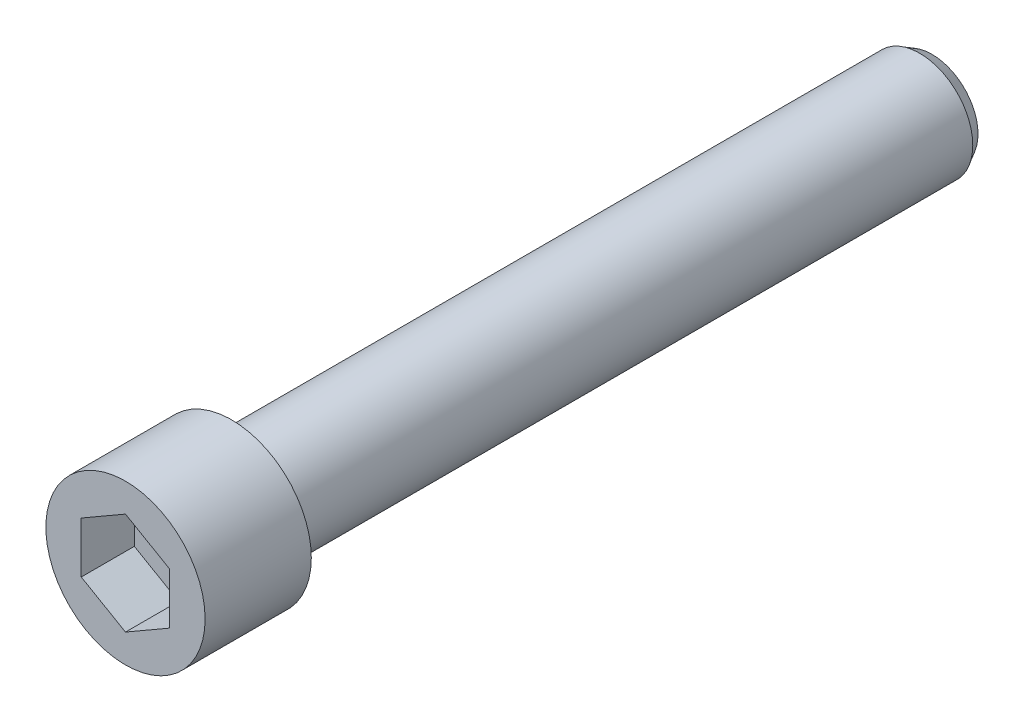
ISO-10303-21;
HEADER;
FILE_DESCRIPTION(('STEP AP214'),'2;1');
FILE_NAME('part.step','',(''),(''),'','','');
FILE_SCHEMA(('AUTOMOTIVE_DESIGN { 1 0 10303 214 1 1 1 1 }'));
ENDSEC;
DATA;
#1=APPLICATION_CONTEXT('core data for automotive mechanical design processes');
#2=APPLICATION_PROTOCOL_DEFINITION('international standard','automotive_design',2000,#1);
#3=PRODUCT_CONTEXT('',#1,'mechanical');
#4=PRODUCT('Part','Part','',(#3));
#5=PRODUCT_RELATED_PRODUCT_CATEGORY('part','',(#4));
#6=PRODUCT_DEFINITION_FORMATION('','',#4);
#7=PRODUCT_DEFINITION_CONTEXT('part definition',#1,'design');
#8=PRODUCT_DEFINITION('design','',#6,#7);
#9=PRODUCT_DEFINITION_SHAPE('','',#8);
#10=(LENGTH_UNIT() NAMED_UNIT(*) SI_UNIT(.MILLI.,.METRE.));
#11=(NAMED_UNIT(*) PLANE_ANGLE_UNIT() SI_UNIT($,.RADIAN.));
#12=(NAMED_UNIT(*) SI_UNIT($,.STERADIAN.) SOLID_ANGLE_UNIT());
#13=UNCERTAINTY_MEASURE_WITH_UNIT(LENGTH_MEASURE(1.E-05),#10,'distance_accuracy_value','');
#14=(GEOMETRIC_REPRESENTATION_CONTEXT(3) GLOBAL_UNCERTAINTY_ASSIGNED_CONTEXT((#13)) GLOBAL_UNIT_ASSIGNED_CONTEXT((#10,
#11,#12)) REPRESENTATION_CONTEXT('',''));
#15=CARTESIAN_POINT('',(0.,0.,0.));
#16=DIRECTION('',(0.,0.,1.));
#17=DIRECTION('',(1.,0.,0.));
#18=AXIS2_PLACEMENT_3D('',#15,#16,#17);
#19=CARTESIAN_POINT('',(0.,0.,2.35));
#20=DIRECTION('',(0.,0.,-1.));
#21=DIRECTION('',(1.,0.,0.));
#22=AXIS2_PLACEMENT_3D('',#19,#20,#21);
#23=SPHERICAL_SURFACE('',#22,4.35);
#24=CARTESIAN_POINT('',(0.,0.,0.85));
#25=DIRECTION('',(0.,0.,-1.));
#26=DIRECTION('',(1.,0.,0.));
#27=AXIS2_PLACEMENT_3D('',#24,#25,#26);
#28=CIRCLE('',#27,4.08319727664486);
#29=CARTESIAN_POINT('',(4.08319727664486,0.,0.85));
#30=VERTEX_POINT('',#29);
#31=EDGE_CURVE('E9',#30,#30,#28,.T.);
#32=CARTESIAN_POINT('',(0.,0.,0.));
#33=DIRECTION('',(0.,0.,-1.));
#34=DIRECTION('',(1.,0.,0.));
#35=AXIS2_PLACEMENT_3D('',#32,#33,#34);
#36=CIRCLE('',#35,3.66060104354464);
#37=CARTESIAN_POINT('',(3.66060104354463,0.,0.));
#38=VERTEX_POINT('',#37);
#39=EDGE_CURVE('E17',#38,#38,#36,.F.);
#40=CARTESIAN_POINT('',(4.08319727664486,0.,0.85));
#41=CARTESIAN_POINT('',(4.07978079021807,0.,0.840699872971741));
#42=CARTESIAN_POINT('',(4.07633252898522,0.,0.831411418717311));
#43=CARTESIAN_POINT('',(4.06937262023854,0.,0.812858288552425));
#44=CARTESIAN_POINT('',(4.06586097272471,0.,0.803593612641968));
#45=CARTESIAN_POINT('',(4.0587744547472,0.,0.785088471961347));
#46=CARTESIAN_POINT('',(4.05519958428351,0.,0.775848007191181));
#47=CARTESIAN_POINT('',(4.04798678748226,0.,0.757391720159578));
#48=CARTESIAN_POINT('',(4.04434886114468,0.,0.74817589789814));
#49=CARTESIAN_POINT('',(4.03701012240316,0.,0.729769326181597));
#50=CARTESIAN_POINT('',(4.03330930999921,0.,0.720578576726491));
#51=CARTESIAN_POINT('',(4.0258449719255,0.,0.702222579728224));
#52=CARTESIAN_POINT('',(4.02208144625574,0.,0.693057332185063));
#53=CARTESIAN_POINT('',(4.01449185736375,0.,0.674752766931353));
#54=CARTESIAN_POINT('',(4.01066579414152,0.,0.665613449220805));
#55=CARTESIAN_POINT('',(4.00295130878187,0.,0.647361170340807));
#56=CARTESIAN_POINT('',(3.99906288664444,0.,0.638248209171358));
#57=CARTESIAN_POINT('',(3.99122386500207,0.,0.620049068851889));
#58=CARTESIAN_POINT('',(3.98727326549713,0.,0.610962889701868));
#59=CARTESIAN_POINT('',(3.9793100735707,0.,0.592817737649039));
#60=CARTESIAN_POINT('',(3.97529748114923,0.,0.58375876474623));
#61=CARTESIAN_POINT('',(3.96721049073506,0.,0.565668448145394));
#62=CARTESIAN_POINT('',(3.96313609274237,0.,0.556637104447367));
#63=CARTESIAN_POINT('',(3.95492568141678,0.,0.538602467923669));
#64=CARTESIAN_POINT('',(3.95078966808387,0.,0.529599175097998));
#65=CARTESIAN_POINT('',(3.94245621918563,0.,0.51162106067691));
#66=CARTESIAN_POINT('',(3.9382587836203,0.,0.502646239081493));
#67=CARTESIAN_POINT('',(3.92980268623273,0.,0.484725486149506));
#68=CARTESIAN_POINT('',(3.9255440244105,0.,0.475779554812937));
#69=CARTESIAN_POINT('',(3.9169656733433,0.,0.457917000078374));
#70=CARTESIAN_POINT('',(3.91264598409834,0.,0.44900037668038));
#71=CARTESIAN_POINT('',(3.90394577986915,0.,0.431196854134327));
#72=CARTESIAN_POINT('',(3.89956526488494,0.,0.422309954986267));
#73=CARTESIAN_POINT('',(3.89074361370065,0.,0.404566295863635));
#74=CARTESIAN_POINT('',(3.88630247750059,0.,0.395709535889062));
#75=CARTESIAN_POINT('',(3.87735979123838,0.,0.378026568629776));
#76=CARTESIAN_POINT('',(3.87285824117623,0.,0.369200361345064));
#77=CARTESIAN_POINT('',(3.8637949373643,0.,0.351578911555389));
#78=CARTESIAN_POINT('',(3.85923318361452,0.,0.342783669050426));
#79=CARTESIAN_POINT('',(3.85004968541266,0.,0.325224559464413));
#80=CARTESIAN_POINT('',(3.84542794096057,0.,0.316460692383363));
#81=CARTESIAN_POINT('',(3.83612467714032,0.,0.298964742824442));
#82=CARTESIAN_POINT('',(3.83144315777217,0.,0.290232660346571));
#83=CARTESIAN_POINT('',(3.82202056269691,0.,0.272800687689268));
#84=CARTESIAN_POINT('',(3.8172794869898,0.,0.264100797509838));
#85=CARTESIAN_POINT('',(3.80773800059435,0.,0.246733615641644));
#86=CARTESIAN_POINT('',(3.80293758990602,0.,0.238066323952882));
#87=CARTESIAN_POINT('',(3.79327765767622,0.,0.220764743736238));
#88=CARTESIAN_POINT('',(3.78841813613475,0.,0.212130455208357));
#89=CARTESIAN_POINT('',(3.77864020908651,0.,0.194895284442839));
#90=CARTESIAN_POINT('',(3.77372180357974,0.,0.186294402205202));
#91=CARTESIAN_POINT('',(3.76382633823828,0.,0.169126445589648));
#92=CARTESIAN_POINT('',(3.75884927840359,0.,0.160559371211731));
#93=CARTESIAN_POINT('',(3.7488367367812,0.,0.143459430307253));
#94=CARTESIAN_POINT('',(3.7438012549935,0.,0.134926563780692));
#95=CARTESIAN_POINT('',(3.73367210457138,0.,0.117895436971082));
#96=CARTESIAN_POINT('',(3.72857843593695,0.,0.109397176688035));
#97=CARTESIAN_POINT('',(3.7183331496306,0.,0.0924356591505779));
#98=CARTESIAN_POINT('',(3.71318153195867,0.,0.0839724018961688));
#99=CARTESIAN_POINT('',(3.70282058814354,0.,0.0670812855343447));
#100=CARTESIAN_POINT('',(3.69761126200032,0.,0.0586534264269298));
#101=CARTESIAN_POINT('',(3.6871351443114,0.,0.0418334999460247));
#102=CARTESIAN_POINT('',(3.68186835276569,0.,0.0334414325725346));
#103=CARTESIAN_POINT('',(3.67127755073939,0.,0.0166934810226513));
#104=CARTESIAN_POINT('',(3.66595354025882,0.,0.00833759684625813));
#105=CARTESIAN_POINT('',(3.66060104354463,0.,0.));
#106=B_SPLINE_CURVE_WITH_KNOTS('',3,(#40,#41,#42,#43,#44,#45,#46,#47,#48,#49,#50,#51,#52,#53,
#54,#55,#56,#57,#58,#59,#60,#61,#62,#63,#64,#65,#66,#67,#68,#69,#70,#71,#72,#73,#74,#75,#76,#77,
#78,#79,#80,#81,#82,#83,#84,#85,#86,#87,#88,#89,#90,#91,#92,#93,#94,#95,#96,#97,#98,#99,#100,
#101,#102,#103,#104,#105),.UNSPECIFIED.,.F.,.F.,(4,2,2,2,2,2,2,2,2,2,2,2,2,2,2,2,2,2,2,2,2,2,2,
2,2,2,2,2,2,2,2,2,4),(0.,0.0297233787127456,0.0594467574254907,0.0891701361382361,
0.118893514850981,0.148616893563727,0.178340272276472,0.208063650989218,0.237787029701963,
0.267510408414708,0.297233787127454,0.326957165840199,0.356680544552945,0.38640392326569,
0.416127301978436,0.445850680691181,0.475574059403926,0.505297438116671,0.535020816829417,
0.564744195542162,0.594467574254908,0.624190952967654,0.653914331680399,0.683637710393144,
0.71336108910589,0.743084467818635,0.77280784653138,0.802531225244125,0.832254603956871,
0.861977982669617,0.891701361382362,0.921424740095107,0.951148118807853),.UNSPECIFIED.);
#107=EDGE_CURVE('BSEAM14',#30,#38,#106,.T.);
#108=ORIENTED_EDGE('',*,*,#31,.T.);
#109=ORIENTED_EDGE('',*,*,#39,.T.);
#110=ORIENTED_EDGE('',*,*,#107,.T.);
#111=ORIENTED_EDGE('',*,*,#107,.F.);
#112=EDGE_LOOP('',(#108,#110,#109,#111));
#113=FACE_BOUND('',#112,.T.);
#114=ADVANCED_FACE('F14',(#113),#23,.T.);
#115=CARTESIAN_POINT('',(5.19170962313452,0.,0.85));
#116=DIRECTION('',(0.,0.,1.));
#117=DIRECTION('',(-1.,0.,0.));
#118=AXIS2_PLACEMENT_3D('',#115,#116,#117);
#119=PLANE('',#118);
#120=ORIENTED_EDGE('',*,*,#31,.F.);
#121=EDGE_LOOP('',(#120));
#122=FACE_BOUND('',#121,.T.);
#123=CARTESIAN_POINT('',(0.,0.,0.85));
#124=DIRECTION('',(0.,0.,-1.));
#125=DIRECTION('',(1.,0.,0.));
#126=AXIS2_PLACEMENT_3D('',#123,#124,#125);
#127=CIRCLE('',#126,5.19170962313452);
#128=CARTESIAN_POINT('',(5.19170962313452,0.,0.85));
#129=VERTEX_POINT('',#128);
#130=EDGE_CURVE('E22',#129,#129,#127,.T.);
#131=ORIENTED_EDGE('',*,*,#130,.T.);
#132=EDGE_LOOP('',(#131));
#133=FACE_BOUND('',#132,.T.);
#134=ADVANCED_FACE('F137',(#122,#133),#119,.F.);
#135=CARTESIAN_POINT('',(0.,0.,2.25));
#136=DIRECTION('',(0.,0.,1.));
#137=DIRECTION('',(-1.,0.,0.));
#138=AXIS2_PLACEMENT_3D('',#135,#136,#137);
#139=CONICAL_SURFACE('',#138,6.,0.523598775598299);
#140=ORIENTED_EDGE('',*,*,#130,.F.);
#141=EDGE_LOOP('',(#140));
#142=FACE_BOUND('',#141,.T.);
#143=CARTESIAN_POINT('',(0.,0.,2.25));
#144=DIRECTION('',(0.,0.,-1.));
#145=DIRECTION('',(1.,0.,0.));
#146=AXIS2_PLACEMENT_3D('',#143,#144,#145);
#147=CIRCLE('',#146,6.);
#148=CARTESIAN_POINT('',(6.,0.,2.25));
#149=VERTEX_POINT('',#148);
#150=EDGE_CURVE('E131',#149,#149,#147,.T.);
#151=ORIENTED_EDGE('',*,*,#150,.T.);
#152=EDGE_LOOP('',(#151));
#153=FACE_BOUND('',#152,.T.);
#154=ADVANCED_FACE('F139',(#142,#153),#139,.T.);
#155=CARTESIAN_POINT('',(0.,0.,-10.));
#156=DIRECTION('',(0.,0.,-1.));
#157=DIRECTION('',(1.,0.,0.));
#158=AXIS2_PLACEMENT_3D('',#155,#156,#157);
#159=CYLINDRICAL_SURFACE('',#158,6.);
#160=CARTESIAN_POINT('',(0.,0.,80.));
#161=DIRECTION('',(0.,0.,-1.));
#162=DIRECTION('',(1.,0.,0.));
#163=AXIS2_PLACEMENT_3D('',#160,#161,#162);
#164=CIRCLE('',#163,6.);
#165=CARTESIAN_POINT('',(6.,0.,80.));
#166=VERTEX_POINT('',#165);
#167=EDGE_CURVE('E128',#166,#166,#164,.T.);
#168=ORIENTED_EDGE('',*,*,#167,.T.);
#169=EDGE_LOOP('',(#168));
#170=FACE_BOUND('',#169,.T.);
#171=ORIENTED_EDGE('',*,*,#150,.F.);
#172=EDGE_LOOP('',(#171));
#173=FACE_BOUND('',#172,.T.);
#174=ADVANCED_FACE('F142',(#170,#173),#159,.T.);
#175=CARTESIAN_POINT('',(6.,0.,80.));
#176=DIRECTION('',(0.,0.,-1.));
#177=DIRECTION('',(1.,0.,0.));
#178=AXIS2_PLACEMENT_3D('',#175,#176,#177);
#179=PLANE('',#178);
#180=CARTESIAN_POINT('',(0.,0.,80.));
#181=DIRECTION('',(0.,0.,-1.));
#182=DIRECTION('',(1.,0.,0.));
#183=AXIS2_PLACEMENT_3D('',#180,#181,#182);
#184=CIRCLE('',#183,9.);
#185=CARTESIAN_POINT('',(9.,0.,80.));
#186=VERTEX_POINT('',#185);
#187=EDGE_CURVE('E125',#186,#186,#184,.T.);
#188=ORIENTED_EDGE('',*,*,#187,.T.);
#189=EDGE_LOOP('',(#188));
#190=FACE_BOUND('',#189,.T.);
#191=ORIENTED_EDGE('',*,*,#167,.F.);
#192=EDGE_LOOP('',(#191));
#193=FACE_BOUND('',#192,.T.);
#194=ADVANCED_FACE('F147',(#190,#193),#179,.T.);
#195=CARTESIAN_POINT('',(0.,0.,-10.));
#196=DIRECTION('',(0.,0.,-1.));
#197=DIRECTION('',(1.,0.,0.));
#198=AXIS2_PLACEMENT_3D('',#195,#196,#197);
#199=CYLINDRICAL_SURFACE('',#198,9.);
#200=CARTESIAN_POINT('',(0.,0.,92.));
#201=DIRECTION('',(0.,0.,-1.));
#202=DIRECTION('',(1.,0.,0.));
#203=AXIS2_PLACEMENT_3D('',#200,#201,#202);
#204=CIRCLE('',#203,9.);
#205=CARTESIAN_POINT('',(9.,0.,92.));
#206=VERTEX_POINT('',#205);
#207=EDGE_CURVE('E122',#206,#206,#204,.T.);
#208=ORIENTED_EDGE('',*,*,#207,.T.);
#209=EDGE_LOOP('',(#208));
#210=FACE_BOUND('',#209,.T.);
#211=ORIENTED_EDGE('',*,*,#187,.F.);
#212=EDGE_LOOP('',(#211));
#213=FACE_BOUND('',#212,.T.);
#214=ADVANCED_FACE('F154',(#210,#213),#199,.T.);
#215=CARTESIAN_POINT('',(9.,0.,92.));
#216=DIRECTION('',(0.,0.,1.));
#217=DIRECTION('',(-1.,0.,0.));
#218=AXIS2_PLACEMENT_3D('',#215,#216,#217);
#219=PLANE('',#218);
#220=DIRECTION('',(-0.86602540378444,0.5,0.));
#221=VECTOR('',#220,1.);
#222=CARTESIAN_POINT('',(5.,2.88675134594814,92.));
#223=LINE('',#222,#221);
#224=CARTESIAN_POINT('',(5.,2.88675134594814,92.));
#225=VERTEX_POINT('',#224);
#226=CARTESIAN_POINT('',(0.,5.77350269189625,92.));
#227=VERTEX_POINT('',#226);
#228=EDGE_CURVE('E29',#225,#227,#223,.T.);
#229=ORIENTED_EDGE('',*,*,#228,.F.);
#230=DIRECTION('',(0.,1.,0.));
#231=VECTOR('',#230,1.);
#232=CARTESIAN_POINT('',(5.,-2.88675134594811,92.));
#233=LINE('',#232,#231);
#234=CARTESIAN_POINT('',(5.,-2.88675134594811,92.));
#235=VERTEX_POINT('',#234);
#236=EDGE_CURVE('E98',#235,#225,#233,.T.);
#237=ORIENTED_EDGE('',*,*,#236,.F.);
#238=DIRECTION('',(-0.866025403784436,-0.5,0.));
#239=VECTOR('',#238,1.);
#240=CARTESIAN_POINT('',(5.,-2.88675134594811,92.));
#241=LINE('',#240,#239);
#242=CARTESIAN_POINT('',(0.,-5.77350269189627,92.));
#243=VERTEX_POINT('',#242);
#244=EDGE_CURVE('E93',#235,#243,#241,.T.);
#245=ORIENTED_EDGE('',*,*,#244,.T.);
#246=DIRECTION('',(0.866025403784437,-0.5,0.));
#247=VECTOR('',#246,1.);
#248=CARTESIAN_POINT('',(-5.,-2.88675134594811,92.));
#249=LINE('',#248,#247);
#250=CARTESIAN_POINT('',(-5.,-2.88675134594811,92.));
#251=VERTEX_POINT('',#250);
#252=EDGE_CURVE('E91',#251,#243,#249,.T.);
#253=ORIENTED_EDGE('',*,*,#252,.F.);
#254=DIRECTION('',(0.,1.,0.));
#255=VECTOR('',#254,1.);
#256=CARTESIAN_POINT('',(-5.,-2.88675134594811,92.));
#257=LINE('',#256,#255);
#258=CARTESIAN_POINT('',(-5.,2.88675134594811,92.));
#259=VERTEX_POINT('',#258);
#260=EDGE_CURVE('E72',#251,#259,#257,.T.);
#261=ORIENTED_EDGE('',*,*,#260,.T.);
#262=DIRECTION('',(0.866025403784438,0.5,0.));
#263=VECTOR('',#262,1.);
#264=CARTESIAN_POINT('',(-5.,2.88675134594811,92.));
#265=LINE('',#264,#263);
#266=EDGE_CURVE('E83',#259,#227,#265,.T.);
#267=ORIENTED_EDGE('',*,*,#266,.T.);
#268=EDGE_LOOP('',(#229,#237,#245,#253,#261,#267));
#269=FACE_BOUND('',#268,.T.);
#270=ORIENTED_EDGE('',*,*,#207,.F.);
#271=EDGE_LOOP('',(#270));
#272=FACE_BOUND('',#271,.T.);
#273=ADVANCED_FACE('F87',(#269,#272),#219,.T.);
#274=CARTESIAN_POINT('',(5.,2.88675134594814,86.));
#275=DIRECTION('',(0.5,0.86602540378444,0.));
#276=DIRECTION('',(0.86602540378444,-0.5,0.));
#277=AXIS2_PLACEMENT_3D('',#274,#275,#276);
#278=PLANE('',#277);
#279=DIRECTION('',(0.,0.,1.));
#280=VECTOR('',#279,1.);
#281=CARTESIAN_POINT('',(5.,2.88675134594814,86.));
#282=LINE('',#281,#280);
#283=CARTESIAN_POINT('',(5.,2.88675134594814,86.));
#284=VERTEX_POINT('',#283);
#285=EDGE_CURVE('E36',#284,#225,#282,.T.);
#286=ORIENTED_EDGE('',*,*,#285,.T.);
#287=ORIENTED_EDGE('',*,*,#228,.T.);
#288=DIRECTION('',(0.,0.,1.));
#289=VECTOR('',#288,1.);
#290=CARTESIAN_POINT('',(0.,5.77350269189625,86.));
#291=LINE('',#290,#289);
#292=CARTESIAN_POINT('',(0.,5.77350269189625,86.));
#293=VERTEX_POINT('',#292);
#294=EDGE_CURVE('E80',#293,#227,#291,.T.);
#295=ORIENTED_EDGE('',*,*,#294,.F.);
#296=DIRECTION('',(-0.86602540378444,0.5,0.));
#297=VECTOR('',#296,1.);
#298=CARTESIAN_POINT('',(5.,2.88675134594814,86.));
#299=LINE('',#298,#297);
#300=EDGE_CURVE('E100',#284,#293,#299,.T.);
#301=ORIENTED_EDGE('',*,*,#300,.F.);
#302=EDGE_LOOP('',(#286,#287,#295,#301));
#303=FACE_BOUND('',#302,.T.);
#304=ADVANCED_FACE('F185',(#303),#278,.F.);
#305=CARTESIAN_POINT('',(5.,-2.88675134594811,86.));
#306=DIRECTION('',(1.,0.,0.));
#307=DIRECTION('',(0.,-1.,0.));
#308=AXIS2_PLACEMENT_3D('',#305,#306,#307);
#309=PLANE('',#308);
#310=DIRECTION('',(0.,0.,1.));
#311=VECTOR('',#310,1.);
#312=CARTESIAN_POINT('',(5.,-2.88675134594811,86.));
#313=LINE('',#312,#311);
#314=CARTESIAN_POINT('',(5.,-2.88675134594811,86.));
#315=VERTEX_POINT('',#314);
#316=EDGE_CURVE('E119',#315,#235,#313,.T.);
#317=ORIENTED_EDGE('',*,*,#316,.T.);
#318=ORIENTED_EDGE('',*,*,#236,.T.);
#319=ORIENTED_EDGE('',*,*,#285,.F.);
#320=DIRECTION('',(0.,1.,0.));
#321=VECTOR('',#320,1.);
#322=CARTESIAN_POINT('',(5.,-2.88675134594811,86.));
#323=LINE('',#322,#321);
#324=EDGE_CURVE('E112',#315,#284,#323,.T.);
#325=ORIENTED_EDGE('',*,*,#324,.F.);
#326=EDGE_LOOP('',(#317,#318,#319,#325));
#327=FACE_BOUND('',#326,.T.);
#328=ADVANCED_FACE('F193',(#327),#309,.F.);
#329=CARTESIAN_POINT('',(5.,-2.88675134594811,86.));
#330=DIRECTION('',(-0.5,0.866025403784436,0.));
#331=DIRECTION('',(0.866025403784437,0.5,0.));
#332=AXIS2_PLACEMENT_3D('',#329,#330,#331);
#333=PLANE('',#332);
#334=DIRECTION('',(0.,0.,1.));
#335=VECTOR('',#334,1.);
#336=CARTESIAN_POINT('',(0.,-5.77350269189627,86.));
#337=LINE('',#336,#335);
#338=CARTESIAN_POINT('',(0.,-5.77350269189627,86.));
#339=VERTEX_POINT('',#338);
#340=EDGE_CURVE('E117',#339,#243,#337,.T.);
#341=ORIENTED_EDGE('',*,*,#340,.T.);
#342=ORIENTED_EDGE('',*,*,#244,.F.);
#343=ORIENTED_EDGE('',*,*,#316,.F.);
#344=DIRECTION('',(-0.866025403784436,-0.5,0.));
#345=VECTOR('',#344,1.);
#346=CARTESIAN_POINT('',(5.,-2.88675134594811,86.));
#347=LINE('',#346,#345);
#348=EDGE_CURVE('E109',#315,#339,#347,.T.);
#349=ORIENTED_EDGE('',*,*,#348,.T.);
#350=EDGE_LOOP('',(#341,#342,#343,#349));
#351=FACE_BOUND('',#350,.T.);
#352=ADVANCED_FACE('F189',(#351),#333,.T.);
#353=CARTESIAN_POINT('',(-5.,-2.88675134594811,86.));
#354=DIRECTION('',(-0.5,-0.866025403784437,0.));
#355=DIRECTION('',(-0.866025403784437,0.5,0.));
#356=AXIS2_PLACEMENT_3D('',#353,#354,#355);
#357=PLANE('',#356);
#358=DIRECTION('',(0.,0.,1.));
#359=VECTOR('',#358,1.);
#360=CARTESIAN_POINT('',(-5.,-2.88675134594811,86.));
#361=LINE('',#360,#359);
#362=CARTESIAN_POINT('',(-5.,-2.88675134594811,86.));
#363=VERTEX_POINT('',#362);
#364=EDGE_CURVE('E79',#363,#251,#361,.T.);
#365=ORIENTED_EDGE('',*,*,#364,.T.);
#366=ORIENTED_EDGE('',*,*,#252,.T.);
#367=ORIENTED_EDGE('',*,*,#340,.F.);
#368=DIRECTION('',(0.866025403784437,-0.5,0.));
#369=VECTOR('',#368,1.);
#370=CARTESIAN_POINT('',(-5.,-2.88675134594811,86.));
#371=LINE('',#370,#369);
#372=EDGE_CURVE('E106',#363,#339,#371,.T.);
#373=ORIENTED_EDGE('',*,*,#372,.F.);
#374=EDGE_LOOP('',(#365,#366,#367,#373));
#375=FACE_BOUND('',#374,.T.);
#376=ADVANCED_FACE('F182',(#375),#357,.F.);
#377=CARTESIAN_POINT('',(-5.,-2.88675134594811,86.));
#378=DIRECTION('',(1.,0.,0.));
#379=DIRECTION('',(0.,-1.,0.));
#380=AXIS2_PLACEMENT_3D('',#377,#378,#379);
#381=PLANE('',#380);
#382=DIRECTION('',(0.,0.,1.));
#383=VECTOR('',#382,1.);
#384=CARTESIAN_POINT('',(-5.,2.88675134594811,86.));
#385=LINE('',#384,#383);
#386=CARTESIAN_POINT('',(-5.,2.88675134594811,86.));
#387=VERTEX_POINT('',#386);
#388=EDGE_CURVE('E68',#387,#259,#385,.T.);
#389=ORIENTED_EDGE('',*,*,#388,.T.);
#390=ORIENTED_EDGE('',*,*,#260,.F.);
#391=ORIENTED_EDGE('',*,*,#364,.F.);
#392=DIRECTION('',(0.,1.,0.));
#393=VECTOR('',#392,1.);
#394=CARTESIAN_POINT('',(-5.,-2.88675134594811,86.));
#395=LINE('',#394,#393);
#396=EDGE_CURVE('E75',#363,#387,#395,.T.);
#397=ORIENTED_EDGE('',*,*,#396,.T.);
#398=EDGE_LOOP('',(#389,#390,#391,#397));
#399=FACE_BOUND('',#398,.T.);
#400=ADVANCED_FACE('F70',(#399),#381,.T.);
#401=CARTESIAN_POINT('',(-5.,2.88675134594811,86.));
#402=DIRECTION('',(0.5,-0.866025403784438,0.));
#403=DIRECTION('',(-0.866025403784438,-0.5,0.));
#404=AXIS2_PLACEMENT_3D('',#401,#402,#403);
#405=PLANE('',#404);
#406=DIRECTION('',(0.866025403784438,0.5,0.));
#407=VECTOR('',#406,1.);
#408=CARTESIAN_POINT('',(-5.,2.88675134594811,86.));
#409=LINE('',#408,#407);
#410=EDGE_CURVE('E103',#387,#293,#409,.T.);
#411=ORIENTED_EDGE('',*,*,#410,.T.);
#412=ORIENTED_EDGE('',*,*,#294,.T.);
#413=ORIENTED_EDGE('',*,*,#266,.F.);
#414=ORIENTED_EDGE('',*,*,#388,.F.);
#415=EDGE_LOOP('',(#411,#412,#413,#414));
#416=FACE_BOUND('',#415,.T.);
#417=ADVANCED_FACE('F84',(#416),#405,.T.);
#418=CARTESIAN_POINT('',(-5.,8.66025403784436,86.));
#419=DIRECTION('',(0.,0.,-1.));
#420=DIRECTION('',(1.,0.,0.));
#421=AXIS2_PLACEMENT_3D('',#418,#419,#420);
#422=PLANE('',#421);
#423=ORIENTED_EDGE('',*,*,#300,.T.);
#424=ORIENTED_EDGE('',*,*,#410,.F.);
#425=ORIENTED_EDGE('',*,*,#396,.F.);
#426=ORIENTED_EDGE('',*,*,#372,.T.);
#427=ORIENTED_EDGE('',*,*,#348,.F.);
#428=ORIENTED_EDGE('',*,*,#324,.T.);
#429=EDGE_LOOP('',(#423,#424,#425,#426,#427,#428));
#430=FACE_BOUND('',#429,.T.);
#431=ADVANCED_FACE('F170',(#430),#422,.F.);
#432=CARTESIAN_POINT('',(0.,0.,0.));
#433=DIRECTION('',(0.,0.,-1.));
#434=DIRECTION('',(1.,0.,0.));
#435=AXIS2_PLACEMENT_3D('',#432,#433,#434);
#436=PLANE('',#435);
#437=ORIENTED_EDGE('',*,*,#39,.F.);
#438=EDGE_LOOP('',(#437));
#439=FACE_BOUND('',#438,.T.);
#440=ADVANCED_FACE('F168',(#439),#436,.T.);
#441=CLOSED_SHELL('',(#114,#134,#154,#174,#194,#214,#273,#304,#328,#352,#376,#400,#417,#431,#440));
#442=MANIFOLD_SOLID_BREP('B1',#441);
#443=ADVANCED_BREP_SHAPE_REPRESENTATION('',(#18,#442),#14);
#444=SHAPE_DEFINITION_REPRESENTATION(#9,#443);
ENDSEC;
END-ISO-10303-21;
